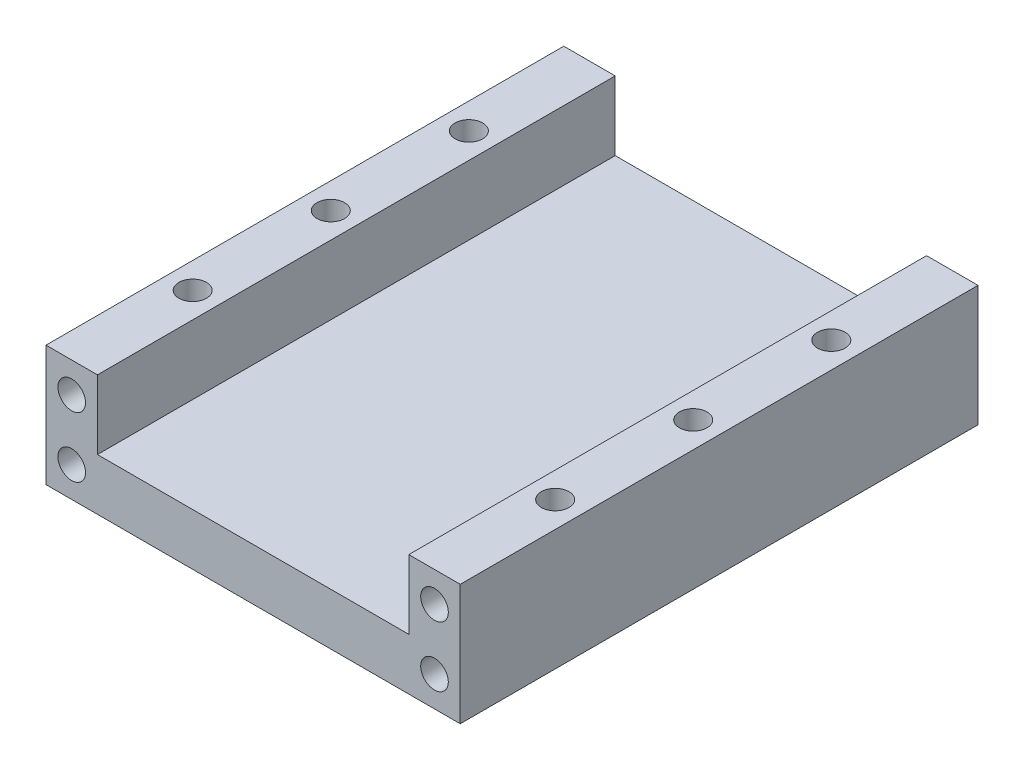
from build123d import *

# Parameters (mm, degrees)
BOSS_EXTRUDE1_DEPTH          = 150
F_8_0_8_DIAMETER_HOLE1_D     = 8
F_8_0_8_DIAMETER_HOLE1_DEPTH = 15
F_8_0_8_DIAMETER_HOLE1_TIP   = 2.403442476
SKETCH6_W                    = 0.1
SKETCH6_H                    = 20
CUT_EXTRUDE1_DEPTH           = 164
F_8_0MM_DOWEL_HOLE1_D        = 8
F_8_0MM_DOWEL_HOLE1_DEPTH    = 15
F_8_0MM_DOWEL_HOLE1_TIP      = 2.403442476
F_8_0MM_DOWEL_HOLE3_D        = 8
F_8_0MM_DOWEL_HOLE3_DEPTH    = 15
F_8_0MM_DOWEL_HOLE3_TIP      = 2.403442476


with BuildPart() as part:
    # Sketch1 → Boss-Extrude1 (new body)
    with BuildSketch(Plane.XY):
        Polygon((-60, 0), (60, 0), (60, 14.057971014), (60, 35), (45, 35), (45, 15), (-45, 15), (-45, 35), (-60, 35), (-60, 14.057971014), align=None)
    extrude(amount=BOSS_EXTRUDE1_DEPTH)

    # 8.0 _8_ Diameter Hole1
    with Locations(Plane(origin=(0, 35, 0), x_dir=(1, 0, 0), z_dir=(0, 1, 0))):
        with Locations((-52.5, -35), (-52.5, -75), (-52.5, -115), (52.5, -115), (52.5, -75), (52.5, -35)):
            Hole(F_8_0_8_DIAMETER_HOLE1_D / 2, depth=F_8_0_8_DIAMETER_HOLE1_DEPTH)
            with Locations((0, 0, -(F_8_0_8_DIAMETER_HOLE1_DEPTH + F_8_0_8_DIAMETER_HOLE1_TIP / 2))):  # 118° drill point
                Cone(0, F_8_0_8_DIAMETER_HOLE1_D / 2, F_8_0_8_DIAMETER_HOLE1_TIP, mode=Mode.SUBTRACT)

    # Sketch6 → Cut-Extrude1 (cut)
    with BuildSketch(Plane.XY.offset(150)):
        with Locations((45.05, 25)):
            Rectangle(SKETCH6_W, SKETCH6_H)
        with Locations((-45.05, 25)):
            Rectangle(SKETCH6_W, SKETCH6_H)
    extrude(amount=-CUT_EXTRUDE1_DEPTH, mode=Mode.SUBTRACT)

    # 8.0mm Dowel Hole1
    with Locations(Plane(origin=(-52.55, 26.25, 150), x_dir=(1, 0, 0), z_dir=(0, 0, 1))):
        with Locations((0, 0), (0, -17.5), (105.1, -17.5), (105.1, 0)):
            Hole(F_8_0MM_DOWEL_HOLE1_D / 2, depth=F_8_0MM_DOWEL_HOLE1_DEPTH)
            with Locations((0, 0, -(F_8_0MM_DOWEL_HOLE1_DEPTH + F_8_0MM_DOWEL_HOLE1_TIP / 2))):  # 118° drill point
                Cone(0, F_8_0MM_DOWEL_HOLE1_D / 2, F_8_0MM_DOWEL_HOLE1_TIP, mode=Mode.SUBTRACT)

    # 8.0mm Dowel Hole3
    with Locations(Plane(origin=(-52.55, 0, 15), x_dir=(0, 0, -1), z_dir=(0, -1, 0))):
        with Locations((0, 0), (-110, 0), (0, 105.1), (-110, 105.1)):
            Hole(F_8_0MM_DOWEL_HOLE3_D / 2, depth=F_8_0MM_DOWEL_HOLE3_DEPTH)
            with Locations((0, 0, -(F_8_0MM_DOWEL_HOLE3_DEPTH + F_8_0MM_DOWEL_HOLE3_TIP / 2))):  # 118° drill point
                Cone(0, F_8_0MM_DOWEL_HOLE3_D / 2, F_8_0MM_DOWEL_HOLE3_TIP, mode=Mode.SUBTRACT)


solid = part.part
